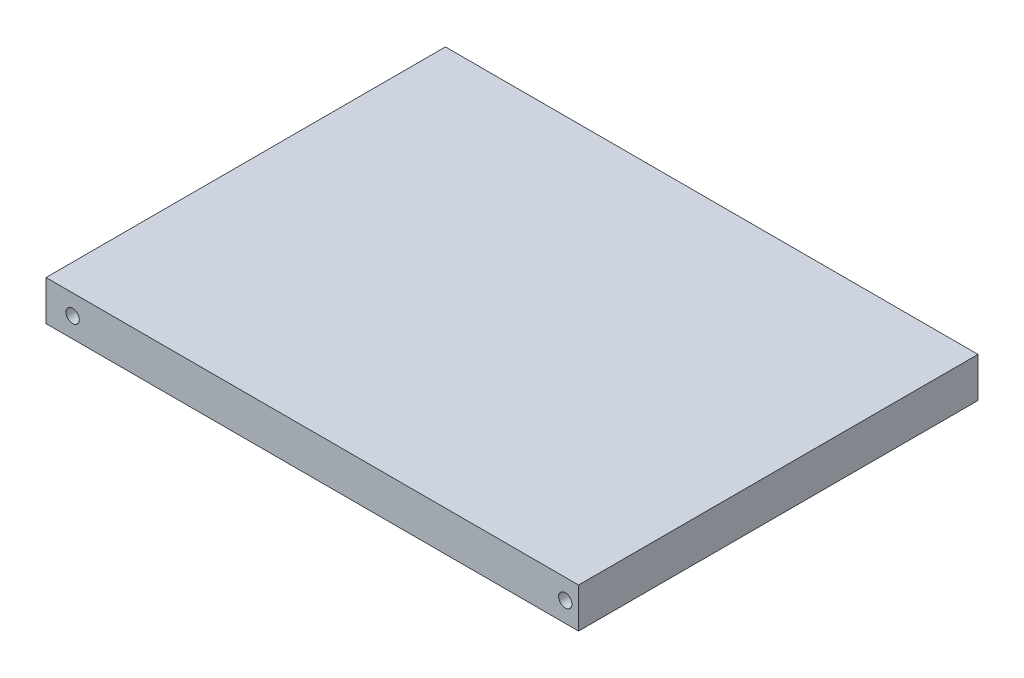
ISO-10303-21;
HEADER;
FILE_DESCRIPTION(('STEP AP214'),'2;1');
FILE_NAME('part.step','',(''),(''),'','','');
FILE_SCHEMA(('AUTOMOTIVE_DESIGN { 1 0 10303 214 1 1 1 1 }'));
ENDSEC;
DATA;
#1=APPLICATION_CONTEXT('core data for automotive mechanical design processes');
#2=APPLICATION_PROTOCOL_DEFINITION('international standard','automotive_design',2000,#1);
#3=PRODUCT_CONTEXT('',#1,'mechanical');
#4=PRODUCT('Part','Part','',(#3));
#5=PRODUCT_RELATED_PRODUCT_CATEGORY('part','',(#4));
#6=PRODUCT_DEFINITION_FORMATION('','',#4);
#7=PRODUCT_DEFINITION_CONTEXT('part definition',#1,'design');
#8=PRODUCT_DEFINITION('design','',#6,#7);
#9=PRODUCT_DEFINITION_SHAPE('','',#8);
#10=(LENGTH_UNIT() NAMED_UNIT(*) SI_UNIT(.MILLI.,.METRE.));
#11=(NAMED_UNIT(*) PLANE_ANGLE_UNIT() SI_UNIT($,.RADIAN.));
#12=(NAMED_UNIT(*) SI_UNIT($,.STERADIAN.) SOLID_ANGLE_UNIT());
#13=UNCERTAINTY_MEASURE_WITH_UNIT(LENGTH_MEASURE(1.E-05),#10,'distance_accuracy_value','');
#14=(GEOMETRIC_REPRESENTATION_CONTEXT(3) GLOBAL_UNCERTAINTY_ASSIGNED_CONTEXT((#13)) GLOBAL_UNIT_ASSIGNED_CONTEXT((#10,
#11,#12)) REPRESENTATION_CONTEXT('',''));
#15=CARTESIAN_POINT('',(0.,0.,0.));
#16=DIRECTION('',(0.,0.,1.));
#17=DIRECTION('',(1.,0.,0.));
#18=AXIS2_PLACEMENT_3D('',#15,#16,#17);
#19=CARTESIAN_POINT('',(0.,30.,150.));
#20=DIRECTION('',(0.,0.,-1.));
#21=DIRECTION('',(-1.,0.,0.));
#22=AXIS2_PLACEMENT_3D('',#19,#20,#21);
#23=PLANE('',#22);
#24=CARTESIAN_POINT('',(20.,15.,150.));
#25=DIRECTION('',(0.,0.,1.));
#26=DIRECTION('',(1.,0.,0.));
#27=AXIS2_PLACEMENT_3D('',#24,#25,#26);
#28=CIRCLE('',#27,5.);
#29=CARTESIAN_POINT('',(25.,15.,150.));
#30=VERTEX_POINT('',#29);
#31=EDGE_CURVE('E103',#30,#30,#28,.T.);
#32=ORIENTED_EDGE('',*,*,#31,.F.);
#33=EDGE_LOOP('',(#32));
#34=FACE_BOUND('',#33,.T.);
#35=DIRECTION('',(0.,-1.,0.));
#36=VECTOR('',#35,1.);
#37=CARTESIAN_POINT('',(0.,0.,150.));
#38=LINE('',#37,#36);
#39=CARTESIAN_POINT('',(0.,30.,150.));
#40=VERTEX_POINT('',#39);
#41=CARTESIAN_POINT('',(0.,0.,150.));
#42=VERTEX_POINT('',#41);
#43=EDGE_CURVE('E88',#40,#42,#38,.T.);
#44=ORIENTED_EDGE('',*,*,#43,.T.);
#45=DIRECTION('',(1.,0.,0.));
#46=VECTOR('',#45,1.);
#47=CARTESIAN_POINT('',(0.,0.,150.));
#48=LINE('',#47,#46);
#49=CARTESIAN_POINT('',(400.,0.,150.));
#50=VERTEX_POINT('',#49);
#51=EDGE_CURVE('E83',#42,#50,#48,.T.);
#52=ORIENTED_EDGE('',*,*,#51,.T.);
#53=DIRECTION('',(0.,1.,0.));
#54=VECTOR('',#53,1.);
#55=CARTESIAN_POINT('',(400.,0.,150.));
#56=LINE('',#55,#54);
#57=CARTESIAN_POINT('',(400.,30.,150.));
#58=VERTEX_POINT('',#57);
#59=EDGE_CURVE('E86',#50,#58,#56,.T.);
#60=ORIENTED_EDGE('',*,*,#59,.T.);
#61=DIRECTION('',(-1.,0.,0.));
#62=VECTOR('',#61,1.);
#63=CARTESIAN_POINT('',(0.,30.,150.));
#64=LINE('',#63,#62);
#65=EDGE_CURVE('E53',#58,#40,#64,.T.);
#66=ORIENTED_EDGE('',*,*,#65,.T.);
#67=EDGE_LOOP('',(#44,#52,#60,#66));
#68=FACE_BOUND('',#67,.T.);
#69=CARTESIAN_POINT('',(390.,15.,150.));
#70=DIRECTION('',(0.,0.,1.));
#71=DIRECTION('',(1.,0.,0.));
#72=AXIS2_PLACEMENT_3D('',#69,#70,#71);
#73=CIRCLE('',#72,4.99999999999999);
#74=CARTESIAN_POINT('',(395.,15.,150.));
#75=VERTEX_POINT('',#74);
#76=EDGE_CURVE('E118',#75,#75,#73,.T.);
#77=ORIENTED_EDGE('',*,*,#76,.F.);
#78=EDGE_LOOP('',(#77));
#79=FACE_BOUND('',#78,.T.);
#80=ADVANCED_FACE('F36',(#34,#68,#79),#23,.F.);
#81=CARTESIAN_POINT('',(0.,30.,-150.));
#82=DIRECTION('',(0.,0.,-1.));
#83=DIRECTION('',(-1.,0.,0.));
#84=AXIS2_PLACEMENT_3D('',#81,#82,#83);
#85=PLANE('',#84);
#86=CARTESIAN_POINT('',(20.,15.,-150.));
#87=DIRECTION('',(0.,0.,1.));
#88=DIRECTION('',(1.,0.,0.));
#89=AXIS2_PLACEMENT_3D('',#86,#87,#88);
#90=CIRCLE('',#89,5.);
#91=CARTESIAN_POINT('',(25.,15.,-150.));
#92=VERTEX_POINT('',#91);
#93=EDGE_CURVE('E115',#92,#92,#90,.T.);
#94=ORIENTED_EDGE('',*,*,#93,.T.);
#95=EDGE_LOOP('',(#94));
#96=FACE_BOUND('',#95,.T.);
#97=DIRECTION('',(0.,-1.,0.));
#98=VECTOR('',#97,1.);
#99=CARTESIAN_POINT('',(0.,0.,-150.));
#100=LINE('',#99,#98);
#101=CARTESIAN_POINT('',(0.,30.,-150.));
#102=VERTEX_POINT('',#101);
#103=CARTESIAN_POINT('',(0.,0.,-150.));
#104=VERTEX_POINT('',#103);
#105=EDGE_CURVE('E100',#102,#104,#100,.T.);
#106=ORIENTED_EDGE('',*,*,#105,.F.);
#107=DIRECTION('',(-1.,0.,0.));
#108=VECTOR('',#107,1.);
#109=CARTESIAN_POINT('',(0.,30.,-150.));
#110=LINE('',#109,#108);
#111=CARTESIAN_POINT('',(400.,30.,-150.));
#112=VERTEX_POINT('',#111);
#113=EDGE_CURVE('E76',#112,#102,#110,.T.);
#114=ORIENTED_EDGE('',*,*,#113,.F.);
#115=DIRECTION('',(0.,1.,0.));
#116=VECTOR('',#115,1.);
#117=CARTESIAN_POINT('',(400.,0.,-150.));
#118=LINE('',#117,#116);
#119=CARTESIAN_POINT('',(400.,0.,-150.));
#120=VERTEX_POINT('',#119);
#121=EDGE_CURVE('E70',#120,#112,#118,.T.);
#122=ORIENTED_EDGE('',*,*,#121,.F.);
#123=DIRECTION('',(1.,0.,0.));
#124=VECTOR('',#123,1.);
#125=CARTESIAN_POINT('',(0.,0.,-150.));
#126=LINE('',#125,#124);
#127=EDGE_CURVE('E92',#104,#120,#126,.T.);
#128=ORIENTED_EDGE('',*,*,#127,.F.);
#129=EDGE_LOOP('',(#106,#114,#122,#128));
#130=FACE_BOUND('',#129,.T.);
#131=CARTESIAN_POINT('',(390.,15.,-150.));
#132=DIRECTION('',(0.,0.,1.));
#133=DIRECTION('',(1.,0.,0.));
#134=AXIS2_PLACEMENT_3D('',#131,#132,#133);
#135=CIRCLE('',#134,4.99999999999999);
#136=CARTESIAN_POINT('',(395.,15.,-150.));
#137=VERTEX_POINT('',#136);
#138=EDGE_CURVE('E121',#137,#137,#135,.T.);
#139=ORIENTED_EDGE('',*,*,#138,.T.);
#140=EDGE_LOOP('',(#139));
#141=FACE_BOUND('',#140,.T.);
#142=ADVANCED_FACE('F111',(#96,#130,#141),#85,.T.);
#143=CARTESIAN_POINT('',(0.,0.,150.));
#144=DIRECTION('',(1.,0.,0.));
#145=DIRECTION('',(0.,0.,-1.));
#146=AXIS2_PLACEMENT_3D('',#143,#144,#145);
#147=PLANE('',#146);
#148=ORIENTED_EDGE('',*,*,#105,.T.);
#149=DIRECTION('',(0.,0.,-1.));
#150=VECTOR('',#149,1.);
#151=CARTESIAN_POINT('',(0.,0.,150.));
#152=LINE('',#151,#150);
#153=EDGE_CURVE('E11',#42,#104,#152,.T.);
#154=ORIENTED_EDGE('',*,*,#153,.F.);
#155=ORIENTED_EDGE('',*,*,#43,.F.);
#156=DIRECTION('',(0.,0.,-1.));
#157=VECTOR('',#156,1.);
#158=CARTESIAN_POINT('',(0.,30.,150.));
#159=LINE('',#158,#157);
#160=EDGE_CURVE('E96',#40,#102,#159,.T.);
#161=ORIENTED_EDGE('',*,*,#160,.T.);
#162=EDGE_LOOP('',(#148,#154,#155,#161));
#163=FACE_BOUND('',#162,.T.);
#164=ADVANCED_FACE('F38',(#163),#147,.F.);
#165=CARTESIAN_POINT('',(0.,0.,150.));
#166=DIRECTION('',(0.,1.,0.));
#167=DIRECTION('',(0.,0.,1.));
#168=AXIS2_PLACEMENT_3D('',#165,#166,#167);
#169=PLANE('',#168);
#170=ORIENTED_EDGE('',*,*,#127,.T.);
#171=DIRECTION('',(0.,0.,-1.));
#172=VECTOR('',#171,1.);
#173=CARTESIAN_POINT('',(400.,0.,150.));
#174=LINE('',#173,#172);
#175=EDGE_CURVE('E45',#50,#120,#174,.T.);
#176=ORIENTED_EDGE('',*,*,#175,.F.);
#177=ORIENTED_EDGE('',*,*,#51,.F.);
#178=ORIENTED_EDGE('',*,*,#153,.T.);
#179=EDGE_LOOP('',(#170,#176,#177,#178));
#180=FACE_BOUND('',#179,.T.);
#181=ADVANCED_FACE('F91',(#180),#169,.F.);
#182=CARTESIAN_POINT('',(400.,0.,150.));
#183=DIRECTION('',(-1.,0.,0.));
#184=DIRECTION('',(0.,0.,1.));
#185=AXIS2_PLACEMENT_3D('',#182,#183,#184);
#186=PLANE('',#185);
#187=ORIENTED_EDGE('',*,*,#121,.T.);
#188=DIRECTION('',(0.,0.,-1.));
#189=VECTOR('',#188,1.);
#190=CARTESIAN_POINT('',(400.,30.,150.));
#191=LINE('',#190,#189);
#192=EDGE_CURVE('E93',#58,#112,#191,.T.);
#193=ORIENTED_EDGE('',*,*,#192,.F.);
#194=ORIENTED_EDGE('',*,*,#59,.F.);
#195=ORIENTED_EDGE('',*,*,#175,.T.);
#196=EDGE_LOOP('',(#187,#193,#194,#195));
#197=FACE_BOUND('',#196,.T.);
#198=ADVANCED_FACE('F94',(#197),#186,.F.);
#199=CARTESIAN_POINT('',(0.,30.,150.));
#200=DIRECTION('',(0.,-1.,0.));
#201=DIRECTION('',(0.,0.,-1.));
#202=AXIS2_PLACEMENT_3D('',#199,#200,#201);
#203=PLANE('',#202);
#204=ORIENTED_EDGE('',*,*,#113,.T.);
#205=ORIENTED_EDGE('',*,*,#160,.F.);
#206=ORIENTED_EDGE('',*,*,#65,.F.);
#207=ORIENTED_EDGE('',*,*,#192,.T.);
#208=EDGE_LOOP('',(#204,#205,#206,#207));
#209=FACE_BOUND('',#208,.T.);
#210=ADVANCED_FACE('F108',(#209),#203,.F.);
#211=CARTESIAN_POINT('',(20.,15.,150.));
#212=DIRECTION('',(0.,0.,-1.));
#213=DIRECTION('',(-1.,0.,0.));
#214=AXIS2_PLACEMENT_3D('',#211,#212,#213);
#215=CYLINDRICAL_SURFACE('',#214,5.);
#216=ORIENTED_EDGE('',*,*,#31,.T.);
#217=EDGE_LOOP('',(#216));
#218=FACE_BOUND('',#217,.T.);
#219=ORIENTED_EDGE('',*,*,#93,.F.);
#220=EDGE_LOOP('',(#219));
#221=FACE_BOUND('',#220,.T.);
#222=ADVANCED_FACE('F139',(#218,#221),#215,.F.);
#223=CARTESIAN_POINT('',(390.,15.,150.));
#224=DIRECTION('',(0.,0.,-1.));
#225=DIRECTION('',(-1.,0.,0.));
#226=AXIS2_PLACEMENT_3D('',#223,#224,#225);
#227=CYLINDRICAL_SURFACE('',#226,4.99999999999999);
#228=ORIENTED_EDGE('',*,*,#76,.T.);
#229=EDGE_LOOP('',(#228));
#230=FACE_BOUND('',#229,.T.);
#231=ORIENTED_EDGE('',*,*,#138,.F.);
#232=EDGE_LOOP('',(#231));
#233=FACE_BOUND('',#232,.T.);
#234=ADVANCED_FACE('F127',(#230,#233),#227,.F.);
#235=CLOSED_SHELL('',(#80,#142,#164,#181,#198,#210,#222,#234));
#236=MANIFOLD_SOLID_BREP('B2',#235);
#237=ADVANCED_BREP_SHAPE_REPRESENTATION('',(#18,#236),#14);
#238=SHAPE_DEFINITION_REPRESENTATION(#9,#237);
ENDSEC;
END-ISO-10303-21;
